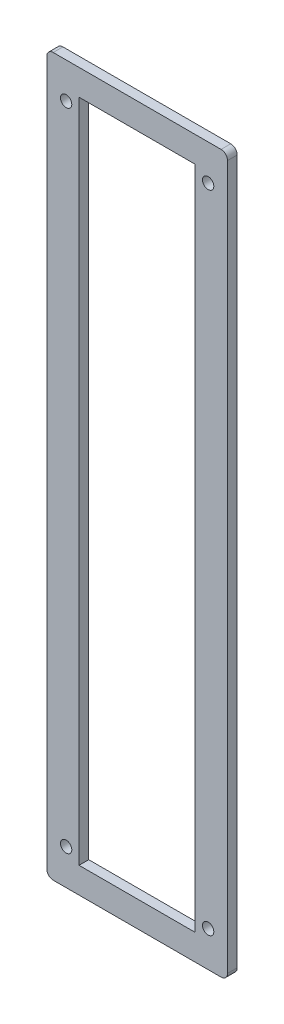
from build123d import *

# Parameters (mm, degrees)
SKETCH1_W                       = 88.9
SKETCH1_H                       = 352.552
BOSS_EXTRUDE1_DEPTH             = 4.7752
SKETCH2_W                       = 57.15
SKETCH2_H                       = 327.152
CUT_EXTRUDE1_DEPTH              = 182.858085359
F_7_32_0_21875_DIAMETER_HOLE1_D = 5.55625
FILLET1_R                       = 3.175


with BuildPart() as part:
    # Sketch1 → Boss-Extrude1 (new body)
    with BuildSketch(Plane.XY):
        with Locations((0.00596135, 0)):
            Rectangle(SKETCH1_W, SKETCH1_H)
    extrude(amount=BOSS_EXTRUDE1_DEPTH)

    # Sketch2 → Cut-Extrude1 (cut, through all)
    with BuildSketch(Plane.XY.offset(4.7752)):
        Rectangle(SKETCH2_W, SKETCH2_H)
    extrude(amount=-CUT_EXTRUDE1_DEPTH, mode=Mode.SUBTRACT)

    # 7_32 _0.21875_ Diameter Hole1 (through all)
    with Locations(Plane.XY.offset(4.7752)):
        with Locations((34.93096135, 158.754356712), (-34.91903865, 158.741826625), (34.93096135, -158.758173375), (-34.91903865, -158.758173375)):
            Hole(F_7_32_0_21875_DIAMETER_HOLE1_D / 2)

    # Fillet1
    fillet1_edges = [part.edges().sort_by_distance(p)[0] for p in [
        (-44.44403865, 176.276, 2.3876),
        (44.45596135, 176.276, 2.3876),
        (44.45596135, -176.276, 2.3876),
        (-44.44403865, -176.276, 2.3876),
    ]]
    fillet(fillet1_edges, radius=FILLET1_R)


solid = part.part
